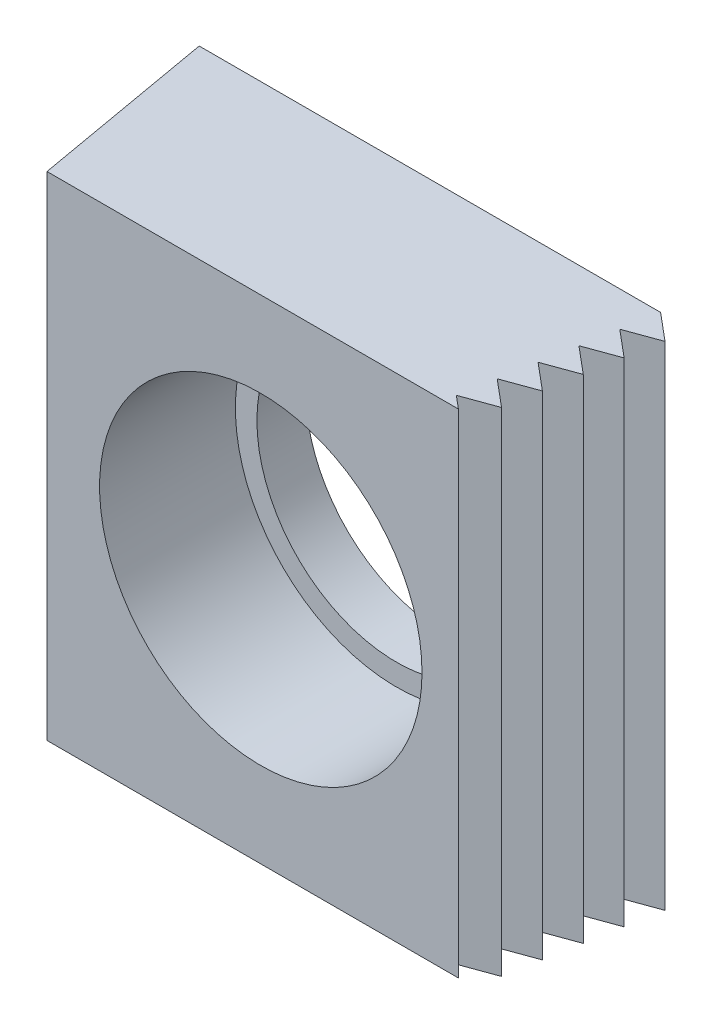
ISO-10303-21;
HEADER;
FILE_DESCRIPTION(('STEP AP214'),'2;1');
FILE_NAME('part.step','',(''),(''),'','','');
FILE_SCHEMA(('AUTOMOTIVE_DESIGN { 1 0 10303 214 1 1 1 1 }'));
ENDSEC;
DATA;
#1=APPLICATION_CONTEXT('core data for automotive mechanical design processes');
#2=APPLICATION_PROTOCOL_DEFINITION('international standard','automotive_design',2000,#1);
#3=PRODUCT_CONTEXT('',#1,'mechanical');
#4=PRODUCT('Part','Part','',(#3));
#5=PRODUCT_RELATED_PRODUCT_CATEGORY('part','',(#4));
#6=PRODUCT_DEFINITION_FORMATION('','',#4);
#7=PRODUCT_DEFINITION_CONTEXT('part definition',#1,'design');
#8=PRODUCT_DEFINITION('design','',#6,#7);
#9=PRODUCT_DEFINITION_SHAPE('','',#8);
#10=(LENGTH_UNIT() NAMED_UNIT(*) SI_UNIT(.MILLI.,.METRE.));
#11=(NAMED_UNIT(*) PLANE_ANGLE_UNIT() SI_UNIT($,.RADIAN.));
#12=(NAMED_UNIT(*) SI_UNIT($,.STERADIAN.) SOLID_ANGLE_UNIT());
#13=UNCERTAINTY_MEASURE_WITH_UNIT(LENGTH_MEASURE(1.E-05),#10,'distance_accuracy_value','');
#14=(GEOMETRIC_REPRESENTATION_CONTEXT(3) GLOBAL_UNCERTAINTY_ASSIGNED_CONTEXT((#13)) GLOBAL_UNIT_ASSIGNED_CONTEXT((#10,
#11,#12)) REPRESENTATION_CONTEXT('',''));
#15=CARTESIAN_POINT('',(0.,0.,0.));
#16=DIRECTION('',(0.,0.,1.));
#17=DIRECTION('',(1.,0.,0.));
#18=AXIS2_PLACEMENT_3D('',#15,#16,#17);
#19=CARTESIAN_POINT('',(12.7,-12.7,9.525));
#20=DIRECTION('',(0.,0.,1.));
#21=DIRECTION('',(0.,1.,0.));
#22=AXIS2_PLACEMENT_3D('',#19,#20,#21);
#23=PLANE('',#22);
#24=CARTESIAN_POINT('',(0.,0.,9.525));
#25=DIRECTION('',(0.,0.,1.));
#26=DIRECTION('',(1.,0.,0.));
#27=AXIS2_PLACEMENT_3D('',#24,#25,#26);
#28=CIRCLE('',#27,8.31);
#29=CARTESIAN_POINT('',(8.31,0.,9.525));
#30=VERTEX_POINT('',#29);
#31=EDGE_CURVE('E439',#30,#30,#28,.T.);
#32=ORIENTED_EDGE('',*,*,#31,.F.);
#33=EDGE_LOOP('',(#32));
#34=FACE_BOUND('',#33,.T.);
#35=DIRECTION('',(1.,0.,0.));
#36=VECTOR('',#35,1.);
#37=CARTESIAN_POINT('',(-12.7,-12.7,9.525));
#38=LINE('',#37,#36);
#39=CARTESIAN_POINT('',(-11.0204855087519,-12.7,9.525));
#40=VERTEX_POINT('',#39);
#41=CARTESIAN_POINT('',(10.1861075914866,-12.7,9.525));
#42=VERTEX_POINT('',#41);
#43=EDGE_CURVE('E22',#40,#42,#38,.T.);
#44=ORIENTED_EDGE('',*,*,#43,.T.);
#45=DIRECTION('',(0.,1.,0.));
#46=VECTOR('',#45,1.);
#47=CARTESIAN_POINT('',(10.1861075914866,-12.7,9.525));
#48=LINE('',#47,#46);
#49=CARTESIAN_POINT('',(10.1861075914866,12.7,9.525));
#50=VERTEX_POINT('',#49);
#51=EDGE_CURVE('E214',#42,#50,#48,.T.);
#52=ORIENTED_EDGE('',*,*,#51,.T.);
#53=DIRECTION('',(-1.,0.,0.));
#54=VECTOR('',#53,1.);
#55=CARTESIAN_POINT('',(-12.7,12.7,9.525));
#56=LINE('',#55,#54);
#57=CARTESIAN_POINT('',(-11.0204855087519,12.7,9.525));
#58=VERTEX_POINT('',#57);
#59=EDGE_CURVE('E9',#50,#58,#56,.T.);
#60=ORIENTED_EDGE('',*,*,#59,.T.);
#61=DIRECTION('',(0.,-1.,0.));
#62=VECTOR('',#61,1.);
#63=CARTESIAN_POINT('',(-11.0204855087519,-12.7,9.525));
#64=LINE('',#63,#62);
#65=EDGE_CURVE('E195',#58,#40,#64,.T.);
#66=ORIENTED_EDGE('',*,*,#65,.T.);
#67=EDGE_LOOP('',(#44,#52,#60,#66));
#68=FACE_BOUND('',#67,.T.);
#69=ADVANCED_FACE('F14',(#34,#68),#23,.T.);
#70=CARTESIAN_POINT('',(12.7,-12.7,0.));
#71=DIRECTION('',(0.,0.,1.));
#72=DIRECTION('',(0.,1.,0.));
#73=AXIS2_PLACEMENT_3D('',#70,#71,#72);
#74=PLANE('',#73);
#75=CARTESIAN_POINT('',(0.,0.,0.));
#76=DIRECTION('',(0.,0.,1.));
#77=DIRECTION('',(1.,0.,0.));
#78=AXIS2_PLACEMENT_3D('',#75,#76,#77);
#79=CIRCLE('',#78,7.2);
#80=CARTESIAN_POINT('',(7.2,0.,0.));
#81=VERTEX_POINT('',#80);
#82=EDGE_CURVE('E443',#81,#81,#79,.T.);
#83=ORIENTED_EDGE('',*,*,#82,.T.);
#84=EDGE_LOOP('',(#83));
#85=FACE_BOUND('',#84,.T.);
#86=DIRECTION('',(0.,1.,0.));
#87=VECTOR('',#86,1.);
#88=CARTESIAN_POINT('',(11.0844240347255,-12.7,0.));
#89=LINE('',#88,#87);
#90=CARTESIAN_POINT('',(11.0844240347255,-12.7,0.));
#91=VERTEX_POINT('',#90);
#92=CARTESIAN_POINT('',(11.0844240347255,12.7,0.));
#93=VERTEX_POINT('',#92);
#94=EDGE_CURVE('E193',#91,#93,#89,.T.);
#95=ORIENTED_EDGE('',*,*,#94,.F.);
#96=DIRECTION('',(1.,0.,0.));
#97=VECTOR('',#96,1.);
#98=CARTESIAN_POINT('',(-12.7,-12.7,0.));
#99=LINE('',#98,#97);
#100=CARTESIAN_POINT('',(-12.7,-12.7,0.));
#101=VERTEX_POINT('',#100);
#102=EDGE_CURVE('E217',#101,#91,#99,.T.);
#103=ORIENTED_EDGE('',*,*,#102,.F.);
#104=DIRECTION('',(0.,-1.,0.));
#105=VECTOR('',#104,1.);
#106=CARTESIAN_POINT('',(-12.7,-12.7,0.));
#107=LINE('',#106,#105);
#108=CARTESIAN_POINT('',(-12.7,12.7,0.));
#109=VERTEX_POINT('',#108);
#110=EDGE_CURVE('E222',#109,#101,#107,.T.);
#111=ORIENTED_EDGE('',*,*,#110,.F.);
#112=DIRECTION('',(-1.,0.,0.));
#113=VECTOR('',#112,1.);
#114=CARTESIAN_POINT('',(-12.7,12.7,0.));
#115=LINE('',#114,#113);
#116=EDGE_CURVE('E220',#93,#109,#115,.T.);
#117=ORIENTED_EDGE('',*,*,#116,.F.);
#118=EDGE_LOOP('',(#95,#103,#111,#117));
#119=FACE_BOUND('',#118,.T.);
#120=ADVANCED_FACE('F248',(#85,#119),#74,.F.);
#121=CARTESIAN_POINT('',(-12.7,-12.7,9.525));
#122=DIRECTION('',(0.,1.,0.));
#123=DIRECTION('',(-1.,0.,0.));
#124=AXIS2_PLACEMENT_3D('',#121,#122,#123);
#125=PLANE('',#124);
#126=DIRECTION('',(-0.766044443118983,0.,-0.642787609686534));
#127=VECTOR('',#126,1.);
#128=CARTESIAN_POINT('',(12.4917742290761,-12.7,1.18090702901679));
#129=LINE('',#128,#127);
#130=CARTESIAN_POINT('',(12.4917742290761,-12.7,1.18090702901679));
#131=VERTEX_POINT('',#130);
#132=EDGE_CURVE('E191',#131,#91,#129,.T.);
#133=ORIENTED_EDGE('',*,*,#132,.F.);
#134=DIRECTION('',(0.939692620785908,0.,-0.34202014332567));
#135=VECTOR('',#134,1.);
#136=CARTESIAN_POINT('',(10.7830161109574,-12.7,1.80284412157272));
#137=LINE('',#136,#135);
#138=CARTESIAN_POINT('',(10.7830161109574,-12.7,1.80284412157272));
#139=VERTEX_POINT('',#138);
#140=EDGE_CURVE('E188',#139,#131,#137,.T.);
#141=ORIENTED_EDGE('',*,*,#140,.F.);
#142=DIRECTION('',(-0.766044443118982,0.,-0.642787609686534));
#143=VECTOR('',#142,1.);
#144=CARTESIAN_POINT('',(12.176008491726,-12.7,2.9717035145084));
#145=LINE('',#144,#143);
#146=CARTESIAN_POINT('',(12.176008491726,-12.7,2.9717035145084));
#147=VERTEX_POINT('',#146);
#148=EDGE_CURVE('E185',#147,#139,#145,.T.);
#149=ORIENTED_EDGE('',*,*,#148,.F.);
#150=DIRECTION('',(0.939692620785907,0.,-0.342020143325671));
#151=VECTOR('',#150,1.);
#152=CARTESIAN_POINT('',(10.4672503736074,-12.7,3.59364060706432));
#153=LINE('',#152,#151);
#154=CARTESIAN_POINT('',(10.4672503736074,-12.7,3.59364060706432));
#155=VERTEX_POINT('',#154);
#156=EDGE_CURVE('E182',#155,#147,#153,.T.);
#157=ORIENTED_EDGE('',*,*,#156,.F.);
#158=DIRECTION('',(-0.766044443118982,0.,-0.642787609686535));
#159=VECTOR('',#158,1.);
#160=CARTESIAN_POINT('',(11.860242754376,-12.7,4.7625));
#161=LINE('',#160,#159);
#162=CARTESIAN_POINT('',(11.860242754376,-12.7,4.7625));
#163=VERTEX_POINT('',#162);
#164=EDGE_CURVE('E179',#163,#155,#161,.T.);
#165=ORIENTED_EDGE('',*,*,#164,.F.);
#166=DIRECTION('',(0.939692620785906,0.,-0.342020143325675));
#167=VECTOR('',#166,1.);
#168=CARTESIAN_POINT('',(11.860242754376,-12.7,4.7625));
#169=LINE('',#168,#167);
#170=CARTESIAN_POINT('',(10.1514846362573,-12.7,5.38443709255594));
#171=VERTEX_POINT('',#170);
#172=EDGE_CURVE('E176',#171,#163,#169,.T.);
#173=ORIENTED_EDGE('',*,*,#172,.F.);
#174=DIRECTION('',(-0.766044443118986,0.,-0.64278760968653));
#175=VECTOR('',#174,1.);
#176=CARTESIAN_POINT('',(10.1514846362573,-12.7,5.38443709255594));
#177=LINE('',#176,#175);
#178=CARTESIAN_POINT('',(11.5444770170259,-12.7,6.5532964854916));
#179=VERTEX_POINT('',#178);
#180=EDGE_CURVE('E173',#179,#171,#177,.T.);
#181=ORIENTED_EDGE('',*,*,#180,.F.);
#182=DIRECTION('',(0.939692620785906,0.,-0.342020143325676));
#183=VECTOR('',#182,1.);
#184=CARTESIAN_POINT('',(11.5444770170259,-12.7,6.5532964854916));
#185=LINE('',#184,#183);
#186=CARTESIAN_POINT('',(9.83571889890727,-12.7,7.17523357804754));
#187=VERTEX_POINT('',#186);
#188=EDGE_CURVE('E170',#187,#179,#185,.T.);
#189=ORIENTED_EDGE('',*,*,#188,.F.);
#190=DIRECTION('',(-0.766044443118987,0.,-0.642787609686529));
#191=VECTOR('',#190,1.);
#192=CARTESIAN_POINT('',(9.83571889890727,-12.7,7.17523357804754));
#193=LINE('',#192,#191);
#194=CARTESIAN_POINT('',(11.2287112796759,-12.7,8.3440929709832));
#195=VERTEX_POINT('',#194);
#196=EDGE_CURVE('E168',#195,#187,#193,.T.);
#197=ORIENTED_EDGE('',*,*,#196,.F.);
#198=DIRECTION('',(0.939692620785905,0.,-0.342020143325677));
#199=VECTOR('',#198,1.);
#200=CARTESIAN_POINT('',(11.2287112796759,-12.7,8.3440929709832));
#201=LINE('',#200,#199);
#202=CARTESIAN_POINT('',(9.51995316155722,-12.7,8.96603006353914));
#203=VERTEX_POINT('',#202);
#204=EDGE_CURVE('E118',#203,#195,#201,.T.);
#205=ORIENTED_EDGE('',*,*,#204,.F.);
#206=DIRECTION('',(-0.766044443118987,0.,-0.642787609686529));
#207=VECTOR('',#206,1.);
#208=CARTESIAN_POINT('',(9.51995316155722,-12.7,8.96603006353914));
#209=LINE('',#208,#207);
#210=EDGE_CURVE('E165',#42,#203,#209,.T.);
#211=ORIENTED_EDGE('',*,*,#210,.F.);
#212=ORIENTED_EDGE('',*,*,#43,.F.);
#213=DIRECTION('',(0.173648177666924,0.,0.984807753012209));
#214=VECTOR('',#213,1.);
#215=CARTESIAN_POINT('',(-12.7,-12.7,0.));
#216=LINE('',#215,#214);
#217=EDGE_CURVE('E163',#101,#40,#216,.T.);
#218=ORIENTED_EDGE('',*,*,#217,.F.);
#219=ORIENTED_EDGE('',*,*,#102,.T.);
#220=EDGE_LOOP('',(#133,#141,#149,#157,#165,#173,#181,#189,#197,#205,#211,#212,#218,#219));
#221=FACE_BOUND('',#220,.T.);
#222=ADVANCED_FACE('F16',(#221),#125,.F.);
#223=CARTESIAN_POINT('',(-12.7,12.7,9.525));
#224=DIRECTION('',(0.,-1.,0.));
#225=DIRECTION('',(1.,0.,0.));
#226=AXIS2_PLACEMENT_3D('',#223,#224,#225);
#227=PLANE('',#226);
#228=DIRECTION('',(-0.766044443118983,0.,-0.642787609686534));
#229=VECTOR('',#228,1.);
#230=CARTESIAN_POINT('',(12.4917742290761,12.7,1.18090702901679));
#231=LINE('',#230,#229);
#232=CARTESIAN_POINT('',(12.4917742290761,12.7,1.18090702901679));
#233=VERTEX_POINT('',#232);
#234=EDGE_CURVE('E161',#233,#93,#231,.T.);
#235=ORIENTED_EDGE('',*,*,#234,.T.);
#236=ORIENTED_EDGE('',*,*,#116,.T.);
#237=DIRECTION('',(0.173648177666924,0.,0.984807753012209));
#238=VECTOR('',#237,1.);
#239=CARTESIAN_POINT('',(-12.7,12.7,0.));
#240=LINE('',#239,#238);
#241=EDGE_CURVE('E37',#109,#58,#240,.T.);
#242=ORIENTED_EDGE('',*,*,#241,.T.);
#243=ORIENTED_EDGE('',*,*,#59,.F.);
#244=DIRECTION('',(-0.766044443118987,0.,-0.642787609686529));
#245=VECTOR('',#244,1.);
#246=CARTESIAN_POINT('',(9.51995316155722,12.7,8.96603006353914));
#247=LINE('',#246,#245);
#248=CARTESIAN_POINT('',(9.51995316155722,12.7,8.96603006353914));
#249=VERTEX_POINT('',#248);
#250=EDGE_CURVE('E137',#50,#249,#247,.T.);
#251=ORIENTED_EDGE('',*,*,#250,.T.);
#252=DIRECTION('',(0.939692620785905,0.,-0.342020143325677));
#253=VECTOR('',#252,1.);
#254=CARTESIAN_POINT('',(11.2287112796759,12.7,8.3440929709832));
#255=LINE('',#254,#253);
#256=CARTESIAN_POINT('',(11.2287112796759,12.7,8.3440929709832));
#257=VERTEX_POINT('',#256);
#258=EDGE_CURVE('E29',#249,#257,#255,.T.);
#259=ORIENTED_EDGE('',*,*,#258,.T.);
#260=DIRECTION('',(-0.766044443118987,0.,-0.642787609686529));
#261=VECTOR('',#260,1.);
#262=CARTESIAN_POINT('',(9.83571889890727,12.7,7.17523357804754));
#263=LINE('',#262,#261);
#264=CARTESIAN_POINT('',(9.83571889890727,12.7,7.17523357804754));
#265=VERTEX_POINT('',#264);
#266=EDGE_CURVE('E126',#257,#265,#263,.T.);
#267=ORIENTED_EDGE('',*,*,#266,.T.);
#268=DIRECTION('',(0.939692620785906,0.,-0.342020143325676));
#269=VECTOR('',#268,1.);
#270=CARTESIAN_POINT('',(11.5444770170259,12.7,6.5532964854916));
#271=LINE('',#270,#269);
#272=CARTESIAN_POINT('',(11.5444770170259,12.7,6.5532964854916));
#273=VERTEX_POINT('',#272);
#274=EDGE_CURVE('E131',#265,#273,#271,.T.);
#275=ORIENTED_EDGE('',*,*,#274,.T.);
#276=DIRECTION('',(-0.766044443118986,0.,-0.64278760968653));
#277=VECTOR('',#276,1.);
#278=CARTESIAN_POINT('',(10.1514846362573,12.7,5.38443709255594));
#279=LINE('',#278,#277);
#280=CARTESIAN_POINT('',(10.1514846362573,12.7,5.38443709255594));
#281=VERTEX_POINT('',#280);
#282=EDGE_CURVE('E143',#273,#281,#279,.T.);
#283=ORIENTED_EDGE('',*,*,#282,.T.);
#284=DIRECTION('',(0.939692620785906,0.,-0.342020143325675));
#285=VECTOR('',#284,1.);
#286=CARTESIAN_POINT('',(11.860242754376,12.7,4.7625));
#287=LINE('',#286,#285);
#288=CARTESIAN_POINT('',(11.860242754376,12.7,4.7625));
#289=VERTEX_POINT('',#288);
#290=EDGE_CURVE('E146',#281,#289,#287,.T.);
#291=ORIENTED_EDGE('',*,*,#290,.T.);
#292=DIRECTION('',(-0.766044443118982,0.,-0.642787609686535));
#293=VECTOR('',#292,1.);
#294=CARTESIAN_POINT('',(11.860242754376,12.7,4.7625));
#295=LINE('',#294,#293);
#296=CARTESIAN_POINT('',(10.4672503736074,12.7,3.59364060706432));
#297=VERTEX_POINT('',#296);
#298=EDGE_CURVE('E149',#289,#297,#295,.T.);
#299=ORIENTED_EDGE('',*,*,#298,.T.);
#300=DIRECTION('',(0.939692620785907,0.,-0.342020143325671));
#301=VECTOR('',#300,1.);
#302=CARTESIAN_POINT('',(10.4672503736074,12.7,3.59364060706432));
#303=LINE('',#302,#301);
#304=CARTESIAN_POINT('',(12.176008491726,12.7,2.9717035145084));
#305=VERTEX_POINT('',#304);
#306=EDGE_CURVE('E152',#297,#305,#303,.T.);
#307=ORIENTED_EDGE('',*,*,#306,.T.);
#308=DIRECTION('',(-0.766044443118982,0.,-0.642787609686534));
#309=VECTOR('',#308,1.);
#310=CARTESIAN_POINT('',(12.176008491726,12.7,2.9717035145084));
#311=LINE('',#310,#309);
#312=CARTESIAN_POINT('',(10.7830161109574,12.7,1.80284412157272));
#313=VERTEX_POINT('',#312);
#314=EDGE_CURVE('E155',#305,#313,#311,.T.);
#315=ORIENTED_EDGE('',*,*,#314,.T.);
#316=DIRECTION('',(0.939692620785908,0.,-0.34202014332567));
#317=VECTOR('',#316,1.);
#318=CARTESIAN_POINT('',(10.7830161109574,12.7,1.80284412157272));
#319=LINE('',#318,#317);
#320=EDGE_CURVE('E158',#313,#233,#319,.T.);
#321=ORIENTED_EDGE('',*,*,#320,.T.);
#322=EDGE_LOOP('',(#235,#236,#242,#243,#251,#259,#267,#275,#283,#291,#299,#307,#315,#321));
#323=FACE_BOUND('',#322,.T.);
#324=ADVANCED_FACE('F135',(#323),#227,.F.);
#325=CARTESIAN_POINT('',(-12.7,-12.7,0.));
#326=DIRECTION('',(-0.984807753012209,0.,0.173648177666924));
#327=DIRECTION('',(0.173648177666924,0.,0.984807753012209));
#328=AXIS2_PLACEMENT_3D('',#325,#326,#327);
#329=PLANE('',#328);
#330=ORIENTED_EDGE('',*,*,#241,.F.);
#331=ORIENTED_EDGE('',*,*,#110,.T.);
#332=ORIENTED_EDGE('',*,*,#217,.T.);
#333=ORIENTED_EDGE('',*,*,#65,.F.);
#334=EDGE_LOOP('',(#330,#331,#332,#333));
#335=FACE_BOUND('',#334,.T.);
#336=ADVANCED_FACE('F259',(#335),#329,.T.);
#337=CARTESIAN_POINT('',(12.4917742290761,-12.7,1.18090702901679));
#338=DIRECTION('',(0.642787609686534,0.,-0.766044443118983));
#339=DIRECTION('',(-0.766044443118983,0.,-0.642787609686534));
#340=AXIS2_PLACEMENT_3D('',#337,#338,#339);
#341=PLANE('',#340);
#342=ORIENTED_EDGE('',*,*,#234,.F.);
#343=DIRECTION('',(0.,1.,0.));
#344=VECTOR('',#343,1.);
#345=CARTESIAN_POINT('',(12.4917742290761,-12.7,1.18090702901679));
#346=LINE('',#345,#344);
#347=EDGE_CURVE('E196',#131,#233,#346,.T.);
#348=ORIENTED_EDGE('',*,*,#347,.F.);
#349=ORIENTED_EDGE('',*,*,#132,.T.);
#350=ORIENTED_EDGE('',*,*,#94,.T.);
#351=EDGE_LOOP('',(#342,#348,#349,#350));
#352=FACE_BOUND('',#351,.T.);
#353=ADVANCED_FACE('F265',(#352),#341,.T.);
#354=CARTESIAN_POINT('',(10.7830161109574,-12.7,1.80284412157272));
#355=DIRECTION('',(0.34202014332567,0.,0.939692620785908));
#356=DIRECTION('',(0.939692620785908,0.,-0.34202014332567));
#357=AXIS2_PLACEMENT_3D('',#354,#355,#356);
#358=PLANE('',#357);
#359=ORIENTED_EDGE('',*,*,#320,.F.);
#360=DIRECTION('',(0.,1.,0.));
#361=VECTOR('',#360,1.);
#362=CARTESIAN_POINT('',(10.7830161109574,-12.7,1.80284412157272));
#363=LINE('',#362,#361);
#364=EDGE_CURVE('E198',#139,#313,#363,.T.);
#365=ORIENTED_EDGE('',*,*,#364,.F.);
#366=ORIENTED_EDGE('',*,*,#140,.T.);
#367=ORIENTED_EDGE('',*,*,#347,.T.);
#368=EDGE_LOOP('',(#359,#365,#366,#367));
#369=FACE_BOUND('',#368,.T.);
#370=ADVANCED_FACE('F327',(#369),#358,.T.);
#371=CARTESIAN_POINT('',(12.176008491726,-12.7,2.9717035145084));
#372=DIRECTION('',(0.642787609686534,0.,-0.766044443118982));
#373=DIRECTION('',(-0.766044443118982,0.,-0.642787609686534));
#374=AXIS2_PLACEMENT_3D('',#371,#372,#373);
#375=PLANE('',#374);
#376=ORIENTED_EDGE('',*,*,#314,.F.);
#377=DIRECTION('',(0.,1.,0.));
#378=VECTOR('',#377,1.);
#379=CARTESIAN_POINT('',(12.176008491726,-12.7,2.9717035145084));
#380=LINE('',#379,#378);
#381=EDGE_CURVE('E200',#147,#305,#380,.T.);
#382=ORIENTED_EDGE('',*,*,#381,.F.);
#383=ORIENTED_EDGE('',*,*,#148,.T.);
#384=ORIENTED_EDGE('',*,*,#364,.T.);
#385=EDGE_LOOP('',(#376,#382,#383,#384));
#386=FACE_BOUND('',#385,.T.);
#387=ADVANCED_FACE('F331',(#386),#375,.T.);
#388=CARTESIAN_POINT('',(10.4672503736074,-12.7,3.59364060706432));
#389=DIRECTION('',(0.342020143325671,0.,0.939692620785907));
#390=DIRECTION('',(0.939692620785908,0.,-0.342020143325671));
#391=AXIS2_PLACEMENT_3D('',#388,#389,#390);
#392=PLANE('',#391);
#393=ORIENTED_EDGE('',*,*,#306,.F.);
#394=DIRECTION('',(0.,1.,0.));
#395=VECTOR('',#394,1.);
#396=CARTESIAN_POINT('',(10.4672503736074,-12.7,3.59364060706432));
#397=LINE('',#396,#395);
#398=EDGE_CURVE('E202',#155,#297,#397,.T.);
#399=ORIENTED_EDGE('',*,*,#398,.F.);
#400=ORIENTED_EDGE('',*,*,#156,.T.);
#401=ORIENTED_EDGE('',*,*,#381,.T.);
#402=EDGE_LOOP('',(#393,#399,#400,#401));
#403=FACE_BOUND('',#402,.T.);
#404=ADVANCED_FACE('F335',(#403),#392,.T.);
#405=CARTESIAN_POINT('',(11.860242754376,-12.7,4.7625));
#406=DIRECTION('',(0.642787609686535,0.,-0.766044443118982));
#407=DIRECTION('',(-0.766044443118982,0.,-0.642787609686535));
#408=AXIS2_PLACEMENT_3D('',#405,#406,#407);
#409=PLANE('',#408);
#410=ORIENTED_EDGE('',*,*,#298,.F.);
#411=DIRECTION('',(0.,1.,0.));
#412=VECTOR('',#411,1.);
#413=CARTESIAN_POINT('',(11.860242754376,-12.7,4.7625));
#414=LINE('',#413,#412);
#415=EDGE_CURVE('E204',#163,#289,#414,.T.);
#416=ORIENTED_EDGE('',*,*,#415,.F.);
#417=ORIENTED_EDGE('',*,*,#164,.T.);
#418=ORIENTED_EDGE('',*,*,#398,.T.);
#419=EDGE_LOOP('',(#410,#416,#417,#418));
#420=FACE_BOUND('',#419,.T.);
#421=ADVANCED_FACE('F339',(#420),#409,.T.);
#422=CARTESIAN_POINT('',(11.860242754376,-12.7,4.7625));
#423=DIRECTION('',(0.342020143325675,0.,0.939692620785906));
#424=DIRECTION('',(0.939692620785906,0.,-0.342020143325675));
#425=AXIS2_PLACEMENT_3D('',#422,#423,#424);
#426=PLANE('',#425);
#427=ORIENTED_EDGE('',*,*,#290,.F.);
#428=DIRECTION('',(0.,1.,0.));
#429=VECTOR('',#428,1.);
#430=CARTESIAN_POINT('',(10.1514846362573,-12.7,5.38443709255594));
#431=LINE('',#430,#429);
#432=EDGE_CURVE('E206',#171,#281,#431,.T.);
#433=ORIENTED_EDGE('',*,*,#432,.F.);
#434=ORIENTED_EDGE('',*,*,#172,.T.);
#435=ORIENTED_EDGE('',*,*,#415,.T.);
#436=EDGE_LOOP('',(#427,#433,#434,#435));
#437=FACE_BOUND('',#436,.T.);
#438=ADVANCED_FACE('F343',(#437),#426,.T.);
#439=CARTESIAN_POINT('',(10.1514846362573,-12.7,5.38443709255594));
#440=DIRECTION('',(0.64278760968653,0.,-0.766044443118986));
#441=DIRECTION('',(-0.766044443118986,0.,-0.64278760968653));
#442=AXIS2_PLACEMENT_3D('',#439,#440,#441);
#443=PLANE('',#442);
#444=ORIENTED_EDGE('',*,*,#282,.F.);
#445=DIRECTION('',(0.,1.,0.));
#446=VECTOR('',#445,1.);
#447=CARTESIAN_POINT('',(11.5444770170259,-12.7,6.5532964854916));
#448=LINE('',#447,#446);
#449=EDGE_CURVE('E208',#179,#273,#448,.T.);
#450=ORIENTED_EDGE('',*,*,#449,.F.);
#451=ORIENTED_EDGE('',*,*,#180,.T.);
#452=ORIENTED_EDGE('',*,*,#432,.T.);
#453=EDGE_LOOP('',(#444,#450,#451,#452));
#454=FACE_BOUND('',#453,.T.);
#455=ADVANCED_FACE('F347',(#454),#443,.T.);
#456=CARTESIAN_POINT('',(11.5444770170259,-12.7,6.5532964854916));
#457=DIRECTION('',(0.342020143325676,0.,0.939692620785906));
#458=DIRECTION('',(0.939692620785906,0.,-0.342020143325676));
#459=AXIS2_PLACEMENT_3D('',#456,#457,#458);
#460=PLANE('',#459);
#461=ORIENTED_EDGE('',*,*,#274,.F.);
#462=DIRECTION('',(0.,1.,0.));
#463=VECTOR('',#462,1.);
#464=CARTESIAN_POINT('',(9.83571889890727,-12.7,7.17523357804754));
#465=LINE('',#464,#463);
#466=EDGE_CURVE('E122',#187,#265,#465,.T.);
#467=ORIENTED_EDGE('',*,*,#466,.F.);
#468=ORIENTED_EDGE('',*,*,#188,.T.);
#469=ORIENTED_EDGE('',*,*,#449,.T.);
#470=EDGE_LOOP('',(#461,#467,#468,#469));
#471=FACE_BOUND('',#470,.T.);
#472=ADVANCED_FACE('F351',(#471),#460,.T.);
#473=CARTESIAN_POINT('',(9.83571889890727,-12.7,7.17523357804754));
#474=DIRECTION('',(0.642787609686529,0.,-0.766044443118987));
#475=DIRECTION('',(-0.766044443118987,0.,-0.642787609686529));
#476=AXIS2_PLACEMENT_3D('',#473,#474,#475);
#477=PLANE('',#476);
#478=ORIENTED_EDGE('',*,*,#266,.F.);
#479=DIRECTION('',(0.,1.,0.));
#480=VECTOR('',#479,1.);
#481=CARTESIAN_POINT('',(11.2287112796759,-12.7,8.3440929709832));
#482=LINE('',#481,#480);
#483=EDGE_CURVE('E114',#195,#257,#482,.T.);
#484=ORIENTED_EDGE('',*,*,#483,.F.);
#485=ORIENTED_EDGE('',*,*,#196,.T.);
#486=ORIENTED_EDGE('',*,*,#466,.T.);
#487=EDGE_LOOP('',(#478,#484,#485,#486));
#488=FACE_BOUND('',#487,.T.);
#489=ADVANCED_FACE('F127',(#488),#477,.T.);
#490=CARTESIAN_POINT('',(11.2287112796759,-12.7,8.3440929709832));
#491=DIRECTION('',(0.342020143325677,0.,0.939692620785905));
#492=DIRECTION('',(0.939692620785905,0.,-0.342020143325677));
#493=AXIS2_PLACEMENT_3D('',#490,#491,#492);
#494=PLANE('',#493);
#495=ORIENTED_EDGE('',*,*,#258,.F.);
#496=DIRECTION('',(0.,1.,0.));
#497=VECTOR('',#496,1.);
#498=CARTESIAN_POINT('',(9.51995316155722,-12.7,8.96603006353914));
#499=LINE('',#498,#497);
#500=EDGE_CURVE('E123',#203,#249,#499,.T.);
#501=ORIENTED_EDGE('',*,*,#500,.F.);
#502=ORIENTED_EDGE('',*,*,#204,.T.);
#503=ORIENTED_EDGE('',*,*,#483,.T.);
#504=EDGE_LOOP('',(#495,#501,#502,#503));
#505=FACE_BOUND('',#504,.T.);
#506=ADVANCED_FACE('F116',(#505),#494,.T.);
#507=CARTESIAN_POINT('',(9.51995316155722,-12.7,8.96603006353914));
#508=DIRECTION('',(0.642787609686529,0.,-0.766044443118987));
#509=DIRECTION('',(-0.766044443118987,0.,-0.642787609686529));
#510=AXIS2_PLACEMENT_3D('',#507,#508,#509);
#511=PLANE('',#510);
#512=ORIENTED_EDGE('',*,*,#210,.T.);
#513=ORIENTED_EDGE('',*,*,#500,.T.);
#514=ORIENTED_EDGE('',*,*,#250,.F.);
#515=ORIENTED_EDGE('',*,*,#51,.F.);
#516=EDGE_LOOP('',(#512,#513,#514,#515));
#517=FACE_BOUND('',#516,.T.);
#518=ADVANCED_FACE('F232',(#517),#511,.T.);
#519=CARTESIAN_POINT('',(0.,0.,2.525));
#520=DIRECTION('',(0.,0.,1.));
#521=DIRECTION('',(1.,0.,0.));
#522=AXIS2_PLACEMENT_3D('',#519,#520,#521);
#523=CYLINDRICAL_SURFACE('',#522,8.31);
#524=CARTESIAN_POINT('',(0.,0.,2.525));
#525=DIRECTION('',(0.,0.,1.));
#526=DIRECTION('',(1.,0.,0.));
#527=AXIS2_PLACEMENT_3D('',#524,#525,#526);
#528=CIRCLE('',#527,8.31);
#529=CARTESIAN_POINT('',(8.31,0.,2.525));
#530=VERTEX_POINT('',#529);
#531=EDGE_CURVE('E437',#530,#530,#528,.T.);
#532=ORIENTED_EDGE('',*,*,#531,.F.);
#533=EDGE_LOOP('',(#532));
#534=FACE_BOUND('',#533,.T.);
#535=ORIENTED_EDGE('',*,*,#31,.T.);
#536=EDGE_LOOP('',(#535));
#537=FACE_BOUND('',#536,.T.);
#538=ADVANCED_FACE('F234',(#534,#537),#523,.F.);
#539=CARTESIAN_POINT('',(0.,0.,2.525));
#540=DIRECTION('',(0.,0.,1.));
#541=DIRECTION('',(1.,0.,0.));
#542=AXIS2_PLACEMENT_3D('',#539,#540,#541);
#543=PLANE('',#542);
#544=CARTESIAN_POINT('',(0.,0.,2.525));
#545=DIRECTION('',(0.,0.,1.));
#546=DIRECTION('',(1.,0.,0.));
#547=AXIS2_PLACEMENT_3D('',#544,#545,#546);
#548=CIRCLE('',#547,7.2);
#549=CARTESIAN_POINT('',(7.2,0.,2.525));
#550=VERTEX_POINT('',#549);
#551=EDGE_CURVE('E447',#550,#550,#548,.T.);
#552=ORIENTED_EDGE('',*,*,#551,.F.);
#553=EDGE_LOOP('',(#552));
#554=FACE_BOUND('',#553,.T.);
#555=ORIENTED_EDGE('',*,*,#531,.T.);
#556=EDGE_LOOP('',(#555));
#557=FACE_BOUND('',#556,.T.);
#558=ADVANCED_FACE('F242',(#554,#557),#543,.T.);
#559=CARTESIAN_POINT('',(0.,0.,-7.475));
#560=DIRECTION('',(0.,0.,1.));
#561=DIRECTION('',(1.,0.,0.));
#562=AXIS2_PLACEMENT_3D('',#559,#560,#561);
#563=CYLINDRICAL_SURFACE('',#562,7.2);
#564=ORIENTED_EDGE('',*,*,#551,.T.);
#565=EDGE_LOOP('',(#564));
#566=FACE_BOUND('',#565,.T.);
#567=ORIENTED_EDGE('',*,*,#82,.F.);
#568=EDGE_LOOP('',(#567));
#569=FACE_BOUND('',#568,.T.);
#570=ADVANCED_FACE('F307',(#566,#569),#563,.F.);
#571=CLOSED_SHELL('',(#69,#120,#222,#324,#336,#353,#370,#387,#404,#421,#438,#455,#472,#489,#506,
#518,#538,#558,#570));
#572=MANIFOLD_SOLID_BREP('B1',#571);
#573=ADVANCED_BREP_SHAPE_REPRESENTATION('',(#18,#572),#14);
#574=SHAPE_DEFINITION_REPRESENTATION(#9,#573);
ENDSEC;
END-ISO-10303-21;
